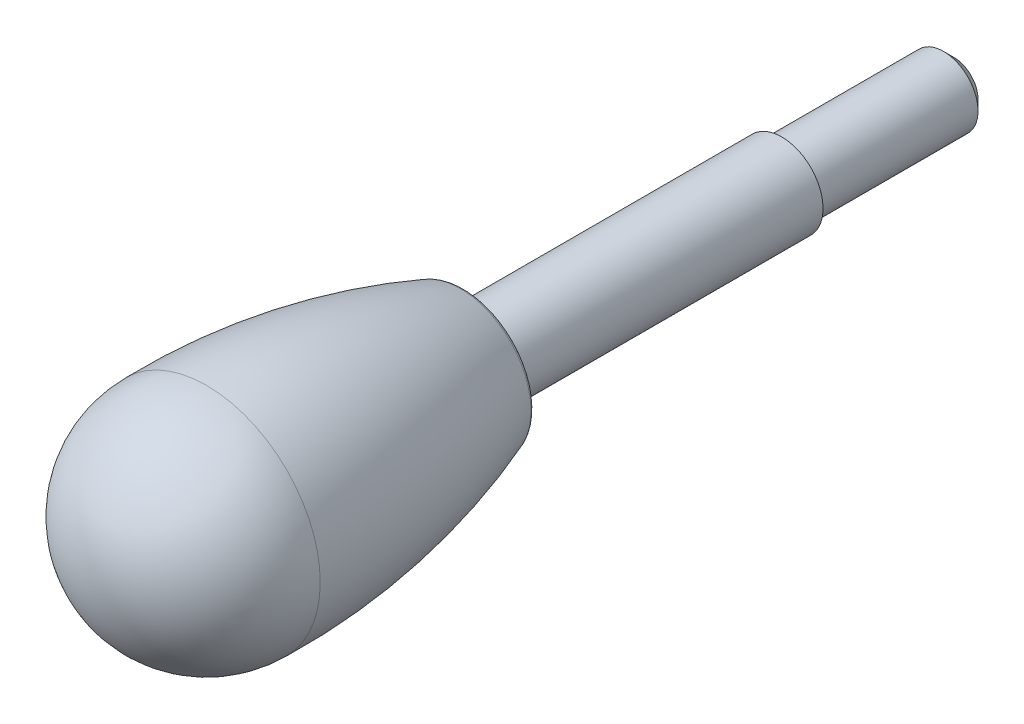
ISO-10303-21;
HEADER;
FILE_DESCRIPTION(('STEP AP214'),'2;1');
FILE_NAME('part.step','',(''),(''),'','','');
FILE_SCHEMA(('AUTOMOTIVE_DESIGN { 1 0 10303 214 1 1 1 1 }'));
ENDSEC;
DATA;
#1=APPLICATION_CONTEXT('core data for automotive mechanical design processes');
#2=APPLICATION_PROTOCOL_DEFINITION('international standard','automotive_design',2000,#1);
#3=PRODUCT_CONTEXT('',#1,'mechanical');
#4=PRODUCT('Part','Part','',(#3));
#5=PRODUCT_RELATED_PRODUCT_CATEGORY('part','',(#4));
#6=PRODUCT_DEFINITION_FORMATION('','',#4);
#7=PRODUCT_DEFINITION_CONTEXT('part definition',#1,'design');
#8=PRODUCT_DEFINITION('design','',#6,#7);
#9=PRODUCT_DEFINITION_SHAPE('','',#8);
#10=(LENGTH_UNIT() NAMED_UNIT(*) SI_UNIT(.MILLI.,.METRE.));
#11=(NAMED_UNIT(*) PLANE_ANGLE_UNIT() SI_UNIT($,.RADIAN.));
#12=(NAMED_UNIT(*) SI_UNIT($,.STERADIAN.) SOLID_ANGLE_UNIT());
#13=UNCERTAINTY_MEASURE_WITH_UNIT(LENGTH_MEASURE(1.E-05),#10,'distance_accuracy_value','');
#14=(GEOMETRIC_REPRESENTATION_CONTEXT(3) GLOBAL_UNCERTAINTY_ASSIGNED_CONTEXT((#13)) GLOBAL_UNIT_ASSIGNED_CONTEXT((#10,
#11,#12)) REPRESENTATION_CONTEXT('',''));
#15=CARTESIAN_POINT('',(0.,0.,0.));
#16=DIRECTION('',(0.,0.,1.));
#17=DIRECTION('',(1.,0.,0.));
#18=AXIS2_PLACEMENT_3D('',#15,#16,#17);
#19=CARTESIAN_POINT('',(0.,0.,83.5));
#20=DIRECTION('',(0.,0.,-1.));
#21=DIRECTION('',(0.,-1.,0.));
#22=AXIS2_PLACEMENT_3D('',#19,#20,#21);
#23=SPHERICAL_SURFACE('',#22,16.5);
#24=CARTESIAN_POINT('',(0.,0.,83.5));
#25=DIRECTION('',(0.,0.,-1.));
#26=DIRECTION('',(0.,-1.,0.));
#27=AXIS2_PLACEMENT_3D('',#24,#25,#26);
#28=CIRCLE('',#27,16.5);
#29=CARTESIAN_POINT('',(0.,-16.5,83.5));
#30=VERTEX_POINT('',#29);
#31=EDGE_CURVE('E8',#30,#30,#28,.T.);
#32=ORIENTED_EDGE('',*,*,#31,.F.);
#33=EDGE_LOOP('',(#32));
#34=FACE_BOUND('',#33,.T.);
#35=ADVANCED_FACE('F12',(#34),#23,.T.);
#36=CARTESIAN_POINT('',(0.,0.,81.6035649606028));
#37=DIRECTION('',(0.,0.,-1.));
#38=DIRECTION('',(0.,-1.,0.));
#39=AXIS2_PLACEMENT_3D('',#36,#37,#38);
#40=DEGENERATE_TOROIDAL_SURFACE('',#39,83.9821055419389,100.5,.F.);
#41=CARTESIAN_POINT('',(0.,0.,46.6522254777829));
#42=DIRECTION('',(0.,0.,-1.));
#43=DIRECTION('',(0.,-1.,0.));
#44=AXIS2_PLACEMENT_3D('',#41,#42,#43);
#45=CIRCLE('',#44,10.2445035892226);
#46=CARTESIAN_POINT('',(0.,-10.2445035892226,46.6522254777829));
#47=VERTEX_POINT('',#46);
#48=EDGE_CURVE('E18',#47,#47,#45,.T.);
#49=ORIENTED_EDGE('',*,*,#48,.F.);
#50=EDGE_LOOP('',(#49));
#51=FACE_BOUND('',#50,.T.);
#52=ORIENTED_EDGE('',*,*,#31,.T.);
#53=EDGE_LOOP('',(#52));
#54=FACE_BOUND('',#53,.T.);
#55=ADVANCED_FACE('F78',(#51,#54),#40,.F.);
#56=CARTESIAN_POINT('',(0.,0.,47.));
#57=DIRECTION('',(0.,0.,-1.));
#58=DIRECTION('',(0.,-1.,0.));
#59=AXIS2_PLACEMENT_3D('',#56,#57,#58);
#60=TOROIDAL_SURFACE('',#59,9.30692538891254,1.);
#61=CARTESIAN_POINT('',(0.,0.,46.));
#62=DIRECTION('',(0.,0.,-1.));
#63=DIRECTION('',(0.,-1.,0.));
#64=AXIS2_PLACEMENT_3D('',#61,#62,#63);
#65=CIRCLE('',#64,9.30692538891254);
#66=CARTESIAN_POINT('',(0.,-9.30692538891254,46.));
#67=VERTEX_POINT('',#66);
#68=EDGE_CURVE('E22',#67,#67,#65,.T.);
#69=ORIENTED_EDGE('',*,*,#68,.F.);
#70=EDGE_LOOP('',(#69));
#71=FACE_BOUND('',#70,.T.);
#72=ORIENTED_EDGE('',*,*,#48,.T.);
#73=EDGE_LOOP('',(#72));
#74=FACE_BOUND('',#73,.T.);
#75=ADVANCED_FACE('F73',(#71,#74),#60,.T.);
#76=CARTESIAN_POINT('',(0.,9.30692538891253,46.));
#77=DIRECTION('',(0.,0.,1.));
#78=DIRECTION('',(0.,1.,0.));
#79=AXIS2_PLACEMENT_3D('',#76,#77,#78);
#80=PLANE('',#79);
#81=CARTESIAN_POINT('',(0.,0.,46.));
#82=DIRECTION('',(0.,0.,-1.));
#83=DIRECTION('',(0.,-1.,0.));
#84=AXIS2_PLACEMENT_3D('',#81,#82,#83);
#85=CIRCLE('',#84,6.);
#86=CARTESIAN_POINT('',(0.,-6.,46.));
#87=VERTEX_POINT('',#86);
#88=EDGE_CURVE('E26',#87,#87,#85,.T.);
#89=ORIENTED_EDGE('',*,*,#88,.F.);
#90=EDGE_LOOP('',(#89));
#91=FACE_BOUND('',#90,.T.);
#92=ORIENTED_EDGE('',*,*,#68,.T.);
#93=EDGE_LOOP('',(#92));
#94=FACE_BOUND('',#93,.T.);
#95=ADVANCED_FACE('F67',(#91,#94),#80,.F.);
#96=CARTESIAN_POINT('',(0.,0.,-30.));
#97=DIRECTION('',(0.,0.,-1.));
#98=DIRECTION('',(0.,-1.,0.));
#99=AXIS2_PLACEMENT_3D('',#96,#97,#98);
#100=CYLINDRICAL_SURFACE('',#99,6.);
#101=CARTESIAN_POINT('',(0.,0.,0.));
#102=DIRECTION('',(0.,0.,-1.));
#103=DIRECTION('',(0.,-1.,0.));
#104=AXIS2_PLACEMENT_3D('',#101,#102,#103);
#105=CIRCLE('',#104,6.);
#106=CARTESIAN_POINT('',(0.,-6.,0.));
#107=VERTEX_POINT('',#106);
#108=EDGE_CURVE('E31',#107,#107,#105,.T.);
#109=ORIENTED_EDGE('',*,*,#108,.F.);
#110=EDGE_LOOP('',(#109));
#111=FACE_BOUND('',#110,.T.);
#112=ORIENTED_EDGE('',*,*,#88,.T.);
#113=EDGE_LOOP('',(#112));
#114=FACE_BOUND('',#113,.T.);
#115=ADVANCED_FACE('F61',(#111,#114),#100,.T.);
#116=CARTESIAN_POINT('',(0.,5.,0.));
#117=DIRECTION('',(0.,0.,1.));
#118=DIRECTION('',(0.,1.,0.));
#119=AXIS2_PLACEMENT_3D('',#116,#117,#118);
#120=PLANE('',#119);
#121=CARTESIAN_POINT('',(0.,0.,0.));
#122=DIRECTION('',(0.,0.,-1.));
#123=DIRECTION('',(0.,-1.,0.));
#124=AXIS2_PLACEMENT_3D('',#121,#122,#123);
#125=CIRCLE('',#124,5.);
#126=CARTESIAN_POINT('',(0.,-5.,0.));
#127=VERTEX_POINT('',#126);
#128=EDGE_CURVE('E34',#127,#127,#125,.T.);
#129=ORIENTED_EDGE('',*,*,#128,.F.);
#130=EDGE_LOOP('',(#129));
#131=FACE_BOUND('',#130,.T.);
#132=ORIENTED_EDGE('',*,*,#108,.T.);
#133=EDGE_LOOP('',(#132));
#134=FACE_BOUND('',#133,.T.);
#135=ADVANCED_FACE('F55',(#131,#134),#120,.F.);
#136=CARTESIAN_POINT('',(0.,0.,-30.));
#137=DIRECTION('',(0.,0.,-1.));
#138=DIRECTION('',(0.,-1.,0.));
#139=AXIS2_PLACEMENT_3D('',#136,#137,#138);
#140=CYLINDRICAL_SURFACE('',#139,5.);
#141=CARTESIAN_POINT('',(0.,0.,-23.5));
#142=DIRECTION('',(0.,0.,-1.));
#143=DIRECTION('',(0.,-1.,0.));
#144=AXIS2_PLACEMENT_3D('',#141,#142,#143);
#145=CIRCLE('',#144,5.);
#146=CARTESIAN_POINT('',(0.,-5.,-23.5));
#147=VERTEX_POINT('',#146);
#148=EDGE_CURVE('E37',#147,#147,#145,.T.);
#149=ORIENTED_EDGE('',*,*,#148,.F.);
#150=EDGE_LOOP('',(#149));
#151=FACE_BOUND('',#150,.T.);
#152=ORIENTED_EDGE('',*,*,#128,.T.);
#153=EDGE_LOOP('',(#152));
#154=FACE_BOUND('',#153,.T.);
#155=ADVANCED_FACE('F49',(#151,#154),#140,.T.);
#156=CARTESIAN_POINT('',(0.,0.,-23.5));
#157=DIRECTION('',(0.,0.,1.));
#158=DIRECTION('',(0.,1.,0.));
#159=AXIS2_PLACEMENT_3D('',#156,#157,#158);
#160=CONICAL_SURFACE('',#159,5.,0.785398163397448);
#161=CARTESIAN_POINT('',(0.,0.,-25.));
#162=DIRECTION('',(0.,0.,-1.));
#163=DIRECTION('',(0.,-1.,0.));
#164=AXIS2_PLACEMENT_3D('',#161,#162,#163);
#165=CIRCLE('',#164,3.5);
#166=CARTESIAN_POINT('',(0.,-3.5,-25.));
#167=VERTEX_POINT('',#166);
#168=EDGE_CURVE('E40',#167,#167,#165,.T.);
#169=ORIENTED_EDGE('',*,*,#168,.F.);
#170=EDGE_LOOP('',(#169));
#171=FACE_BOUND('',#170,.T.);
#172=ORIENTED_EDGE('',*,*,#148,.T.);
#173=EDGE_LOOP('',(#172));
#174=FACE_BOUND('',#173,.T.);
#175=ADVANCED_FACE('F46',(#171,#174),#160,.T.);
#176=CARTESIAN_POINT('',(0.,3.5,-25.));
#177=DIRECTION('',(0.,0.,1.));
#178=DIRECTION('',(0.,1.,0.));
#179=AXIS2_PLACEMENT_3D('',#176,#177,#178);
#180=PLANE('',#179);
#181=ORIENTED_EDGE('',*,*,#168,.T.);
#182=EDGE_LOOP('',(#181));
#183=FACE_BOUND('',#182,.T.);
#184=ADVANCED_FACE('F44',(#183),#180,.F.);
#185=CLOSED_SHELL('',(#35,#55,#75,#95,#115,#135,#155,#175,#184));
#186=MANIFOLD_SOLID_BREP('B1',#185);
#187=ADVANCED_BREP_SHAPE_REPRESENTATION('',(#18,#186),#14);
#188=SHAPE_DEFINITION_REPRESENTATION(#9,#187);
ENDSEC;
END-ISO-10303-21;
